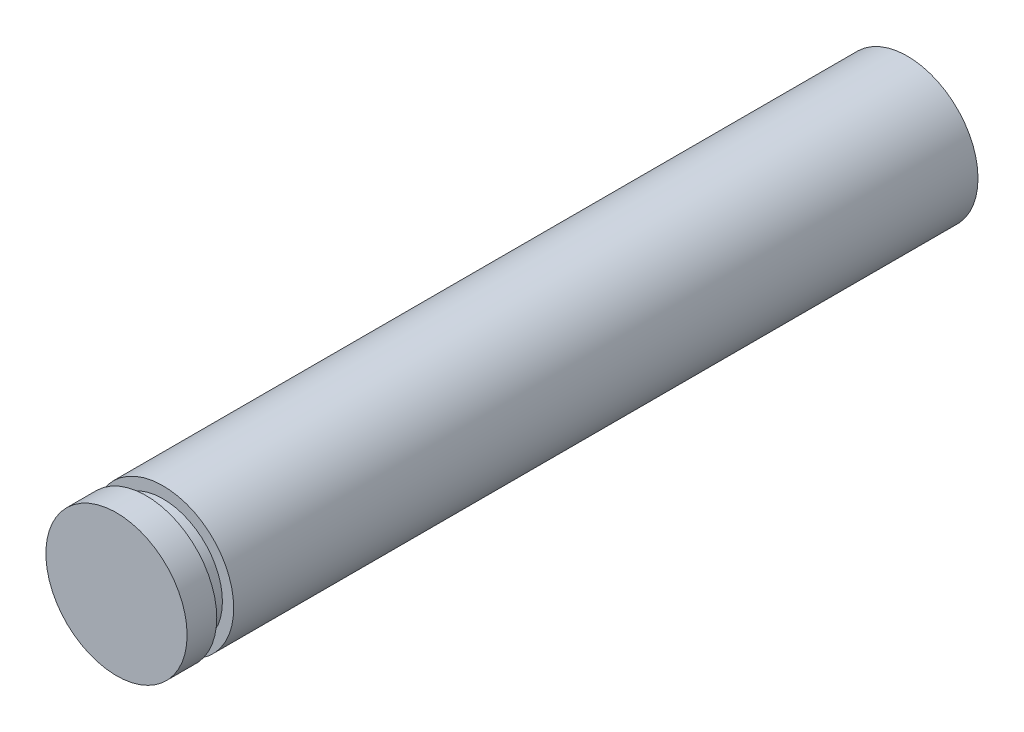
from build123d import *

# Parameters (mm, degrees)
SKETCH1_R           = 3.175
BOSS_EXTRUDE1_DEPTH = 17.78
SKETCH2_W           = 0.762
SKETCH2_H           = 0.508


with BuildPart() as part:
    # Sketch1 → Boss-Extrude1 (new, symmetric)
    with BuildSketch(Plane.XY):
        Circle(SKETCH1_R)
    extrude(amount=BOSS_EXTRUDE1_DEPTH, both=True)

    # Sketch2 → Cut-Revolve1 (revolve, cut)
    with BuildSketch(Plane(origin=(0, 0, 0), x_dir=(0, 0, -1), z_dir=(1, 0, 0)), mode=Mode.PRIVATE) as cut_revolve1_sk:
        with Locations((-16.0655, 2.921)):
            Rectangle(SKETCH2_W, SKETCH2_H)
    revolve(cut_revolve1_sk.sketch.rotate(Axis((0, 0, 17.78), (0, 0, -1)), 90), axis=Axis((0, 0, 17.78), (0, 0, -1)), mode=Mode.SUBTRACT)


solid = part.part
